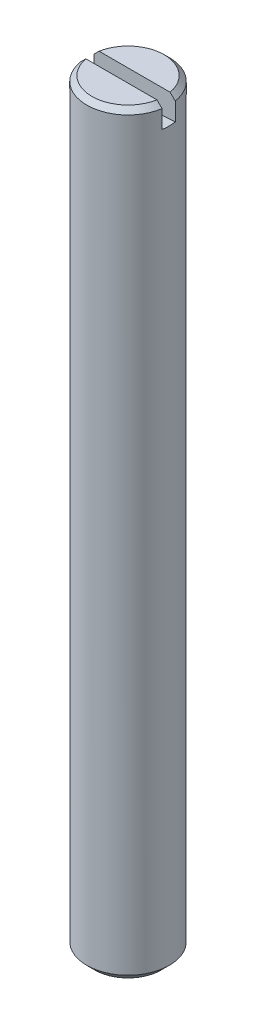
ISO-10303-21;
HEADER;
FILE_DESCRIPTION(('STEP AP214'),'2;1');
FILE_NAME('part.step','',(''),(''),'','','');
FILE_SCHEMA(('AUTOMOTIVE_DESIGN { 1 0 10303 214 1 1 1 1 }'));
ENDSEC;
DATA;
#1=APPLICATION_CONTEXT('core data for automotive mechanical design processes');
#2=APPLICATION_PROTOCOL_DEFINITION('international standard','automotive_design',2000,#1);
#3=PRODUCT_CONTEXT('',#1,'mechanical');
#4=PRODUCT('Part','Part','',(#3));
#5=PRODUCT_RELATED_PRODUCT_CATEGORY('part','',(#4));
#6=PRODUCT_DEFINITION_FORMATION('','',#4);
#7=PRODUCT_DEFINITION_CONTEXT('part definition',#1,'design');
#8=PRODUCT_DEFINITION('design','',#6,#7);
#9=PRODUCT_DEFINITION_SHAPE('','',#8);
#10=(LENGTH_UNIT() NAMED_UNIT(*) SI_UNIT(.MILLI.,.METRE.));
#11=(NAMED_UNIT(*) PLANE_ANGLE_UNIT() SI_UNIT($,.RADIAN.));
#12=(NAMED_UNIT(*) SI_UNIT($,.STERADIAN.) SOLID_ANGLE_UNIT());
#13=UNCERTAINTY_MEASURE_WITH_UNIT(LENGTH_MEASURE(1.E-05),#10,'distance_accuracy_value','');
#14=(GEOMETRIC_REPRESENTATION_CONTEXT(3) GLOBAL_UNCERTAINTY_ASSIGNED_CONTEXT((#13)) GLOBAL_UNIT_ASSIGNED_CONTEXT((#10,
#11,#12)) REPRESENTATION_CONTEXT('',''));
#15=CARTESIAN_POINT('',(0.,0.,0.));
#16=DIRECTION('',(0.,0.,1.));
#17=DIRECTION('',(1.,0.,0.));
#18=AXIS2_PLACEMENT_3D('',#15,#16,#17);
#19=CARTESIAN_POINT('',(0.,36.,0.));
#20=DIRECTION('',(0.,-1.,0.));
#21=DIRECTION('',(0.,0.,-1.));
#22=AXIS2_PLACEMENT_3D('',#19,#20,#21);
#23=PLANE('',#22);
#24=CARTESIAN_POINT('',(0.,36.0000000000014,0.));
#25=DIRECTION('',(0.,-1.,0.));
#26=DIRECTION('',(0.,0.,-1.));
#27=AXIS2_PLACEMENT_3D('',#24,#25,#26);
#28=CIRCLE('',#27,2.19349999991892);
#29=CARTESIAN_POINT('',(-2.15672025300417,35.9999999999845,-0.4));
#30=VERTEX_POINT('',#29);
#31=CARTESIAN_POINT('',(2.15672025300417,35.9999999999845,-0.4));
#32=VERTEX_POINT('',#31);
#33=EDGE_CURVE('E165',#30,#32,#28,.T.);
#34=ORIENTED_EDGE('',*,*,#33,.F.);
#35=DIRECTION('',(1.,0.,0.));
#36=VECTOR('',#35,1.);
#37=CARTESIAN_POINT('',(0.,36.,-0.4));
#38=LINE('',#37,#36);
#39=EDGE_CURVE('E163',#32,#30,#38,.F.);
#40=ORIENTED_EDGE('',*,*,#39,.F.);
#41=EDGE_LOOP('',(#34,#40));
#42=FACE_BOUND('',#41,.T.);
#43=ADVANCED_FACE('F14',(#42),#23,.F.);
#44=CARTESIAN_POINT('',(0.,36.,0.));
#45=DIRECTION('',(0.,-1.,0.));
#46=DIRECTION('',(0.,0.,-1.));
#47=AXIS2_PLACEMENT_3D('',#44,#45,#46);
#48=PLANE('',#47);
#49=DIRECTION('',(1.,0.,0.));
#50=VECTOR('',#49,1.);
#51=CARTESIAN_POINT('',(0.,36.,0.4));
#52=LINE('',#51,#50);
#53=CARTESIAN_POINT('',(-2.15672025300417,35.9999999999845,0.4));
#54=VERTEX_POINT('',#53);
#55=CARTESIAN_POINT('',(2.15672025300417,35.9999999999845,0.4));
#56=VERTEX_POINT('',#55);
#57=EDGE_CURVE('E161',#54,#56,#52,.T.);
#58=ORIENTED_EDGE('',*,*,#57,.F.);
#59=CARTESIAN_POINT('',(0.,36.0000000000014,0.));
#60=DIRECTION('',(0.,-1.,0.));
#61=DIRECTION('',(0.,0.,-1.));
#62=AXIS2_PLACEMENT_3D('',#59,#60,#61);
#63=CIRCLE('',#62,2.19349999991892);
#64=EDGE_CURVE('E159',#56,#54,#63,.T.);
#65=ORIENTED_EDGE('',*,*,#64,.F.);
#66=EDGE_LOOP('',(#58,#65));
#67=FACE_BOUND('',#66,.T.);
#68=ADVANCED_FACE('F121',(#67),#48,.F.);
#69=CARTESIAN_POINT('',(0.,35.6934999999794,0.));
#70=DIRECTION('',(0.,-1.,0.));
#71=DIRECTION('',(0.,0.,-1.));
#72=AXIS2_PLACEMENT_3D('',#69,#70,#71);
#73=CONICAL_SURFACE('',#72,2.49999999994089,0.785398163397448);
#74=CARTESIAN_POINT('',(-2.15672025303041,35.9999999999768,-0.400000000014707));
#75=CARTESIAN_POINT('',(-2.20861576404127,35.9489675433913,-0.400000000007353));
#76=CARTESIAN_POINT('',(-2.26048621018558,35.8979096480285,-0.400000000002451));
#77=CARTESIAN_POINT('',(-2.36417697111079,35.7957429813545,-0.399999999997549));
#78=CARTESIAN_POINT('',(-2.41599728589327,35.7446342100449,-0.399999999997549));
#79=CARTESIAN_POINT('',(-2.46779253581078,35.6934999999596,-0.4));
#80=B_SPLINE_CURVE_WITH_KNOTS('',3,(#74,#75,#76,#77,#78,#79),.UNSPECIFIED.,.F.,.F.,(4,2,4),(0.,
0.218350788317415,0.436701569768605),.UNSPECIFIED.);
#81=CARTESIAN_POINT('',(-2.46779253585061,35.6934999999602,-0.4));
#82=VERTEX_POINT('',#81);
#83=EDGE_CURVE('E39',#30,#82,#80,.T.);
#84=ORIENTED_EDGE('',*,*,#83,.F.);
#85=ORIENTED_EDGE('',*,*,#33,.T.);
#86=CARTESIAN_POINT('',(2.46779253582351,35.6934999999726,-0.400000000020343));
#87=CARTESIAN_POINT('',(2.41599728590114,35.7446342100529,-0.400000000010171));
#88=CARTESIAN_POINT('',(2.36417697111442,35.7957429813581,-0.400000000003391));
#89=CARTESIAN_POINT('',(2.26048621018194,35.8979096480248,-0.39999999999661));
#90=CARTESIAN_POINT('',(2.20861576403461,35.9489675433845,-0.39999999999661));
#91=CARTESIAN_POINT('',(2.15672025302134,35.9999999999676,-0.4));
#92=B_SPLINE_CURVE_WITH_KNOTS('',3,(#86,#87,#88,#89,#90,#91),.UNSPECIFIED.,.F.,.F.,(4,2,4),(0.,
0.218350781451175,0.436701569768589),.UNSPECIFIED.);
#93=CARTESIAN_POINT('',(2.46779253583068,35.6934999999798,-0.4));
#94=VERTEX_POINT('',#93);
#95=EDGE_CURVE('E134',#94,#32,#92,.T.);
#96=ORIENTED_EDGE('',*,*,#95,.F.);
#97=CARTESIAN_POINT('',(0.,35.6935,0.));
#98=DIRECTION('',(0.,-1.,0.));
#99=DIRECTION('',(0.,0.,-1.));
#100=AXIS2_PLACEMENT_3D('',#97,#98,#99);
#101=CIRCLE('',#100,2.5);
#102=EDGE_CURVE('E9',#82,#94,#101,.T.);
#103=ORIENTED_EDGE('',*,*,#102,.F.);
#104=EDGE_LOOP('',(#84,#85,#96,#103));
#105=FACE_BOUND('',#104,.T.);
#106=ADVANCED_FACE('F116',(#105),#73,.T.);
#107=CARTESIAN_POINT('',(0.,66.,-0.4));
#108=DIRECTION('',(0.,0.,1.));
#109=DIRECTION('',(1.,0.,0.));
#110=AXIS2_PLACEMENT_3D('',#107,#108,#109);
#111=PLANE('',#110);
#112=ORIENTED_EDGE('',*,*,#39,.T.);
#113=ORIENTED_EDGE('',*,*,#83,.T.);
#114=DIRECTION('',(0.,1.,0.));
#115=VECTOR('',#114,1.);
#116=CARTESIAN_POINT('',(-2.46779253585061,66.,-0.4));
#117=LINE('',#116,#115);
#118=CARTESIAN_POINT('',(-2.46779253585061,34.596815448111,-0.4));
#119=VERTEX_POINT('',#118);
#120=EDGE_CURVE('E154',#82,#119,#117,.F.);
#121=ORIENTED_EDGE('',*,*,#120,.T.);
#122=CARTESIAN_POINT('',(0.,66.,-0.4));
#123=DIRECTION('',(0.,0.,-1.));
#124=DIRECTION('',(-1.,0.,0.));
#125=AXIS2_PLACEMENT_3D('',#122,#123,#124);
#126=CIRCLE('',#125,31.5);
#127=CARTESIAN_POINT('',(2.46779253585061,34.596815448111,-0.4));
#128=VERTEX_POINT('',#127);
#129=EDGE_CURVE('E88',#119,#128,#126,.F.);
#130=ORIENTED_EDGE('',*,*,#129,.T.);
#131=DIRECTION('',(0.,1.,0.));
#132=VECTOR('',#131,1.);
#133=CARTESIAN_POINT('',(2.46779253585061,66.,-0.4));
#134=LINE('',#133,#132);
#135=EDGE_CURVE('E140',#128,#94,#134,.T.);
#136=ORIENTED_EDGE('',*,*,#135,.T.);
#137=ORIENTED_EDGE('',*,*,#95,.T.);
#138=EDGE_LOOP('',(#112,#113,#121,#130,#136,#137));
#139=FACE_BOUND('',#138,.T.);
#140=ADVANCED_FACE('F120',(#139),#111,.T.);
#141=CARTESIAN_POINT('',(0.,35.6934999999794,0.));
#142=DIRECTION('',(0.,-1.,0.));
#143=DIRECTION('',(0.,0.,-1.));
#144=AXIS2_PLACEMENT_3D('',#141,#142,#143);
#145=CONICAL_SURFACE('',#144,2.49999999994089,0.785398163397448);
#146=ORIENTED_EDGE('',*,*,#64,.T.);
#147=CARTESIAN_POINT('',(-2.15672025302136,35.9999999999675,0.4));
#148=CARTESIAN_POINT('',(-2.20861576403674,35.9489675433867,0.4));
#149=CARTESIAN_POINT('',(-2.26048621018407,35.8979096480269,0.4));
#150=CARTESIAN_POINT('',(-2.36417697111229,35.795742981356,0.4));
#151=CARTESIAN_POINT('',(-2.41599728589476,35.7446342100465,0.4));
#152=CARTESIAN_POINT('',(-2.46779253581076,35.6934999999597,0.4));
#153=B_SPLINE_CURVE_WITH_KNOTS('',3,(#147,#148,#149,#150,#151,#152),.UNSPECIFIED.,.F.,.F.,(4,2,
4),(0.,0.218350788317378,0.436701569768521),.UNSPECIFIED.);
#154=CARTESIAN_POINT('',(-2.46779253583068,35.6934999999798,0.4));
#155=VERTEX_POINT('',#154);
#156=EDGE_CURVE('E149',#54,#155,#153,.T.);
#157=ORIENTED_EDGE('',*,*,#156,.T.);
#158=CARTESIAN_POINT('',(0.,35.6935,0.));
#159=DIRECTION('',(0.,-1.,0.));
#160=DIRECTION('',(0.,0.,-1.));
#161=AXIS2_PLACEMENT_3D('',#158,#159,#160);
#162=CIRCLE('',#161,2.5);
#163=CARTESIAN_POINT('',(2.46779253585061,35.6934999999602,0.4));
#164=VERTEX_POINT('',#163);
#165=EDGE_CURVE('E30',#164,#155,#162,.T.);
#166=ORIENTED_EDGE('',*,*,#165,.F.);
#167=CARTESIAN_POINT('',(2.46779253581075,35.6934999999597,0.4));
#168=CARTESIAN_POINT('',(2.41599728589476,35.7446342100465,0.4));
#169=CARTESIAN_POINT('',(2.36417697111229,35.795742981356,0.4));
#170=CARTESIAN_POINT('',(2.26048621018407,35.8979096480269,0.4));
#171=CARTESIAN_POINT('',(2.20861576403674,35.9489675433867,0.4));
#172=CARTESIAN_POINT('',(2.15672025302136,35.9999999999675,0.4));
#173=B_SPLINE_CURVE_WITH_KNOTS('',3,(#167,#168,#169,#170,#171,#172),.UNSPECIFIED.,.F.,.F.,(4,2,
4),(0.,0.218350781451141,0.436701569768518),.UNSPECIFIED.);
#174=EDGE_CURVE('E96',#164,#56,#173,.T.);
#175=ORIENTED_EDGE('',*,*,#174,.T.);
#176=EDGE_LOOP('',(#146,#157,#166,#175));
#177=FACE_BOUND('',#176,.T.);
#178=ADVANCED_FACE('F122',(#177),#145,.T.);
#179=CARTESIAN_POINT('',(0.,66.,0.4));
#180=DIRECTION('',(0.,0.,1.));
#181=DIRECTION('',(1.,0.,0.));
#182=AXIS2_PLACEMENT_3D('',#179,#180,#181);
#183=PLANE('',#182);
#184=ORIENTED_EDGE('',*,*,#57,.T.);
#185=ORIENTED_EDGE('',*,*,#174,.F.);
#186=DIRECTION('',(0.,1.,0.));
#187=VECTOR('',#186,1.);
#188=CARTESIAN_POINT('',(2.46779253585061,66.,0.4));
#189=LINE('',#188,#187);
#190=CARTESIAN_POINT('',(2.46779253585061,34.596815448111,0.4));
#191=VERTEX_POINT('',#190);
#192=EDGE_CURVE('E94',#191,#164,#189,.T.);
#193=ORIENTED_EDGE('',*,*,#192,.F.);
#194=CARTESIAN_POINT('',(0.,66.,0.4));
#195=DIRECTION('',(0.,0.,-1.));
#196=DIRECTION('',(-1.,0.,0.));
#197=AXIS2_PLACEMENT_3D('',#194,#195,#196);
#198=CIRCLE('',#197,31.5);
#199=CARTESIAN_POINT('',(-2.46779253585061,34.596815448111,0.4));
#200=VERTEX_POINT('',#199);
#201=EDGE_CURVE('E81',#200,#191,#198,.F.);
#202=ORIENTED_EDGE('',*,*,#201,.F.);
#203=DIRECTION('',(0.,1.,0.));
#204=VECTOR('',#203,1.);
#205=CARTESIAN_POINT('',(-2.46779253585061,66.,0.4));
#206=LINE('',#205,#204);
#207=EDGE_CURVE('E73',#155,#200,#206,.F.);
#208=ORIENTED_EDGE('',*,*,#207,.F.);
#209=ORIENTED_EDGE('',*,*,#156,.F.);
#210=EDGE_LOOP('',(#184,#185,#193,#202,#208,#209));
#211=FACE_BOUND('',#210,.T.);
#212=ADVANCED_FACE('F92',(#211),#183,.F.);
#213=CARTESIAN_POINT('',(0.,66.,0.4));
#214=DIRECTION('',(0.,0.,-1.));
#215=DIRECTION('',(-1.,0.,0.));
#216=AXIS2_PLACEMENT_3D('',#213,#214,#215);
#217=CYLINDRICAL_SURFACE('',#216,31.5);
#218=CARTESIAN_POINT('',(2.46779253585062,34.596815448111,-0.4));
#219=CARTESIAN_POINT('',(2.47854531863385,34.5976618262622,-0.333698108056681));
#220=CARTESIAN_POINT('',(2.48661458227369,34.598300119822,-0.266959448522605));
#221=CARTESIAN_POINT('',(2.49732458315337,34.5991493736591,-0.133478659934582));
#222=CARTESIAN_POINT('',(2.5,34.5993630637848,-0.066739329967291));
#223=CARTESIAN_POINT('',(2.5,34.5993630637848,0.066739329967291));
#224=CARTESIAN_POINT('',(2.49732458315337,34.5991493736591,0.133478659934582));
#225=CARTESIAN_POINT('',(2.48661458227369,34.598300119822,0.266959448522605));
#226=CARTESIAN_POINT('',(2.47854531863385,34.5976618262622,0.333698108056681));
#227=CARTESIAN_POINT('',(2.46779253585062,34.596815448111,0.4));
#228=B_SPLINE_CURVE_WITH_KNOTS('',3,(#218,#219,#220,#221,#222,#223,#224,#225,#226,#227),
.UNSPECIFIED.,.F.,.F.,(4,2,2,2,4),(0.,0.201464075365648,0.401628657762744,0.601793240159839,
0.803257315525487),.UNSPECIFIED.);
#229=EDGE_CURVE('E82',#128,#191,#228,.T.);
#230=ORIENTED_EDGE('',*,*,#229,.F.);
#231=ORIENTED_EDGE('',*,*,#129,.F.);
#232=CARTESIAN_POINT('',(-2.46779253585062,34.596815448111,0.4));
#233=CARTESIAN_POINT('',(-2.47854531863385,34.5976618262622,0.333698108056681));
#234=CARTESIAN_POINT('',(-2.48661458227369,34.598300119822,0.266959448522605));
#235=CARTESIAN_POINT('',(-2.49732458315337,34.5991493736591,0.133478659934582));
#236=CARTESIAN_POINT('',(-2.5,34.5993630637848,0.066739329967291));
#237=CARTESIAN_POINT('',(-2.5,34.5993630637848,-0.066739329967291));
#238=CARTESIAN_POINT('',(-2.49732458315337,34.5991493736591,-0.133478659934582));
#239=CARTESIAN_POINT('',(-2.48661458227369,34.598300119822,-0.266959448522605));
#240=CARTESIAN_POINT('',(-2.47854531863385,34.5976618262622,-0.333698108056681));
#241=CARTESIAN_POINT('',(-2.46779253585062,34.596815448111,-0.4));
#242=B_SPLINE_CURVE_WITH_KNOTS('',3,(#232,#233,#234,#235,#236,#237,#238,#239,#240,#241),
.UNSPECIFIED.,.F.,.F.,(4,2,2,2,4),(0.,0.201464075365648,0.401628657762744,0.601793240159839,
0.803257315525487),.UNSPECIFIED.);
#243=EDGE_CURVE('E19',#200,#119,#242,.T.);
#244=ORIENTED_EDGE('',*,*,#243,.F.);
#245=ORIENTED_EDGE('',*,*,#201,.T.);
#246=EDGE_LOOP('',(#230,#231,#244,#245));
#247=FACE_BOUND('',#246,.T.);
#248=ADVANCED_FACE('F16',(#247),#217,.F.);
#249=CARTESIAN_POINT('',(0.,26.5,0.));
#250=DIRECTION('',(0.,-1.,0.));
#251=DIRECTION('',(0.,0.,-1.));
#252=AXIS2_PLACEMENT_3D('',#249,#250,#251);
#253=CYLINDRICAL_SURFACE('',#252,2.5);
#254=ORIENTED_EDGE('',*,*,#229,.T.);
#255=ORIENTED_EDGE('',*,*,#192,.T.);
#256=ORIENTED_EDGE('',*,*,#165,.T.);
#257=ORIENTED_EDGE('',*,*,#207,.T.);
#258=ORIENTED_EDGE('',*,*,#243,.T.);
#259=ORIENTED_EDGE('',*,*,#120,.F.);
#260=ORIENTED_EDGE('',*,*,#102,.T.);
#261=ORIENTED_EDGE('',*,*,#135,.F.);
#262=EDGE_LOOP('',(#254,#255,#256,#257,#258,#259,#260,#261));
#263=FACE_BOUND('',#262,.T.);
#264=CARTESIAN_POINT('',(0.,-9.5095,0.));
#265=DIRECTION('',(0.,-1.,0.));
#266=DIRECTION('',(0.,0.,-1.));
#267=AXIS2_PLACEMENT_3D('',#264,#265,#266);
#268=CIRCLE('',#267,2.5);
#269=CARTESIAN_POINT('',(0.,-9.5095,-2.5));
#270=VERTEX_POINT('',#269);
#271=EDGE_CURVE('E172',#270,#270,#268,.F.);
#272=ORIENTED_EDGE('',*,*,#271,.T.);
#273=EDGE_LOOP('',(#272));
#274=FACE_BOUND('',#273,.T.);
#275=ADVANCED_FACE('F75',(#263,#274),#253,.T.);
#276=CARTESIAN_POINT('',(2.0095,-10.,0.));
#277=DIRECTION('',(0.,1.,0.));
#278=DIRECTION('',(0.,0.,1.));
#279=AXIS2_PLACEMENT_3D('',#276,#277,#278);
#280=PLANE('',#279);
#281=CARTESIAN_POINT('',(0.,-10.0000000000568,0.));
#282=DIRECTION('',(0.,1.,0.));
#283=DIRECTION('',(0.,0.,1.));
#284=AXIS2_PLACEMENT_3D('',#281,#282,#283);
#285=CIRCLE('',#284,2.00949999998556);
#286=CARTESIAN_POINT('',(0.,-10.0000000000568,2.00949999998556));
#287=VERTEX_POINT('',#286);
#288=EDGE_CURVE('E90',#287,#287,#285,.T.);
#289=ORIENTED_EDGE('',*,*,#288,.F.);
#290=EDGE_LOOP('',(#289));
#291=FACE_BOUND('',#290,.T.);
#292=ADVANCED_FACE('F113',(#291),#280,.F.);
#293=CARTESIAN_POINT('',(0.,-9.50949999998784,0.));
#294=DIRECTION('',(0.,1.,0.));
#295=DIRECTION('',(0.,0.,1.));
#296=AXIS2_PLACEMENT_3D('',#293,#294,#295);
#297=CONICAL_SURFACE('',#296,2.50000000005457,0.785398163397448);
#298=ORIENTED_EDGE('',*,*,#271,.F.);
#299=EDGE_LOOP('',(#298));
#300=FACE_BOUND('',#299,.T.);
#301=ORIENTED_EDGE('',*,*,#288,.T.);
#302=EDGE_LOOP('',(#301));
#303=FACE_BOUND('',#302,.T.);
#304=ADVANCED_FACE('F114',(#300,#303),#297,.T.);
#305=CLOSED_SHELL('',(#43,#68,#106,#140,#178,#212,#248,#275,#292,#304));
#306=MANIFOLD_SOLID_BREP('B1',#305);
#307=ADVANCED_BREP_SHAPE_REPRESENTATION('',(#18,#306),#14);
#308=SHAPE_DEFINITION_REPRESENTATION(#9,#307);
ENDSEC;
END-ISO-10303-21;
